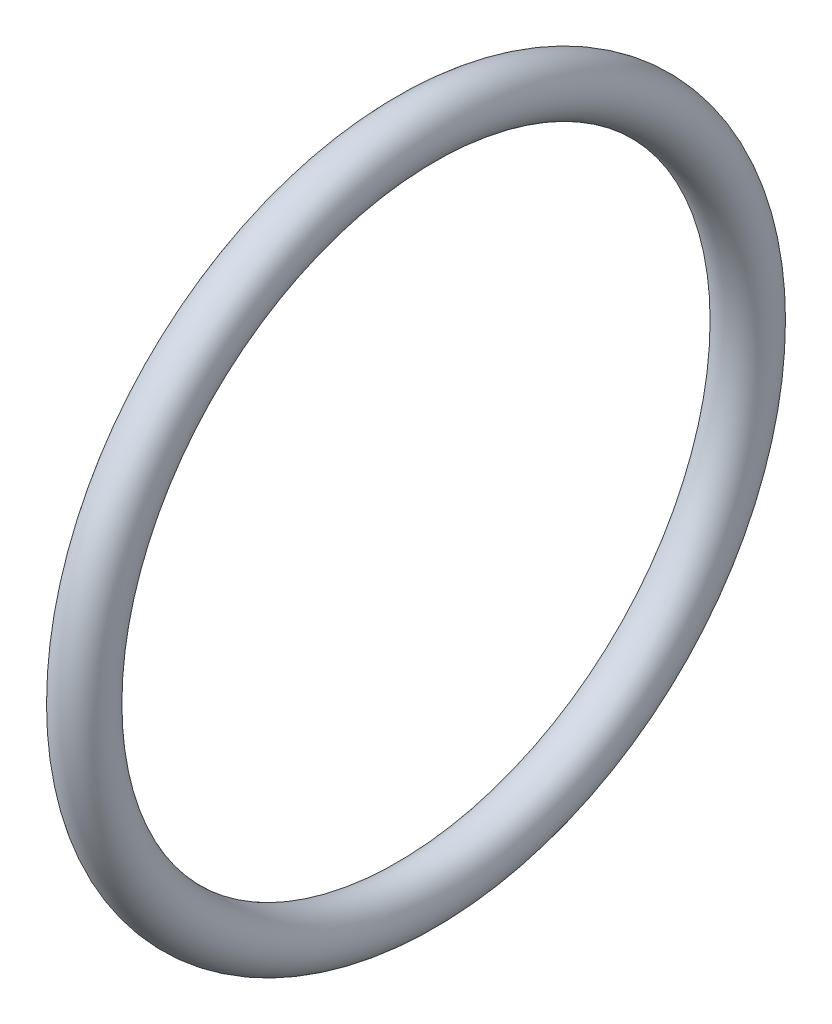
from build123d import *

# Parameters (mm, degrees)
SKETCH1_R = 0.889


with BuildPart() as part:
    # Sketch1 → Base-Revolve (revolve)
    with BuildSketch(Plane.XY, mode=Mode.PRIVATE) as base_revolve_sk:
        with Locations((0, 11.0617)):
            Circle(SKETCH1_R)
    revolve(base_revolve_sk.sketch.rotate(Axis((0, 0, 0), (1, 0, 0)), 90), axis=Axis((0, 0, 0), (1, 0, 0)))


solid = part.part
